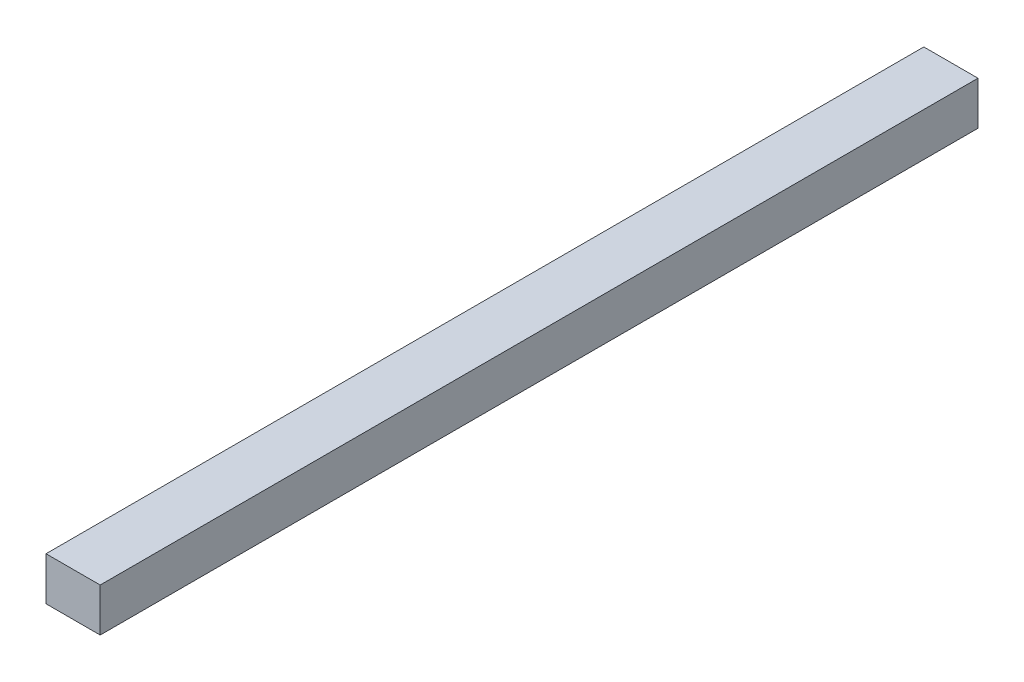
from build123d import *

# Parameters (mm, degrees)
ESQUISSE1_W      = 5
ESQUISSE1_H      = 4
EXTRUSION1_DEPTH = 81


with BuildPart() as part:
    # Esquisse1 → Extrusion1 (new body)
    with BuildSketch(Plane.XY):
        with Locations((2.5, 2)):
            Rectangle(ESQUISSE1_W, ESQUISSE1_H)
    extrude(amount=EXTRUSION1_DEPTH)


solid = part.part
